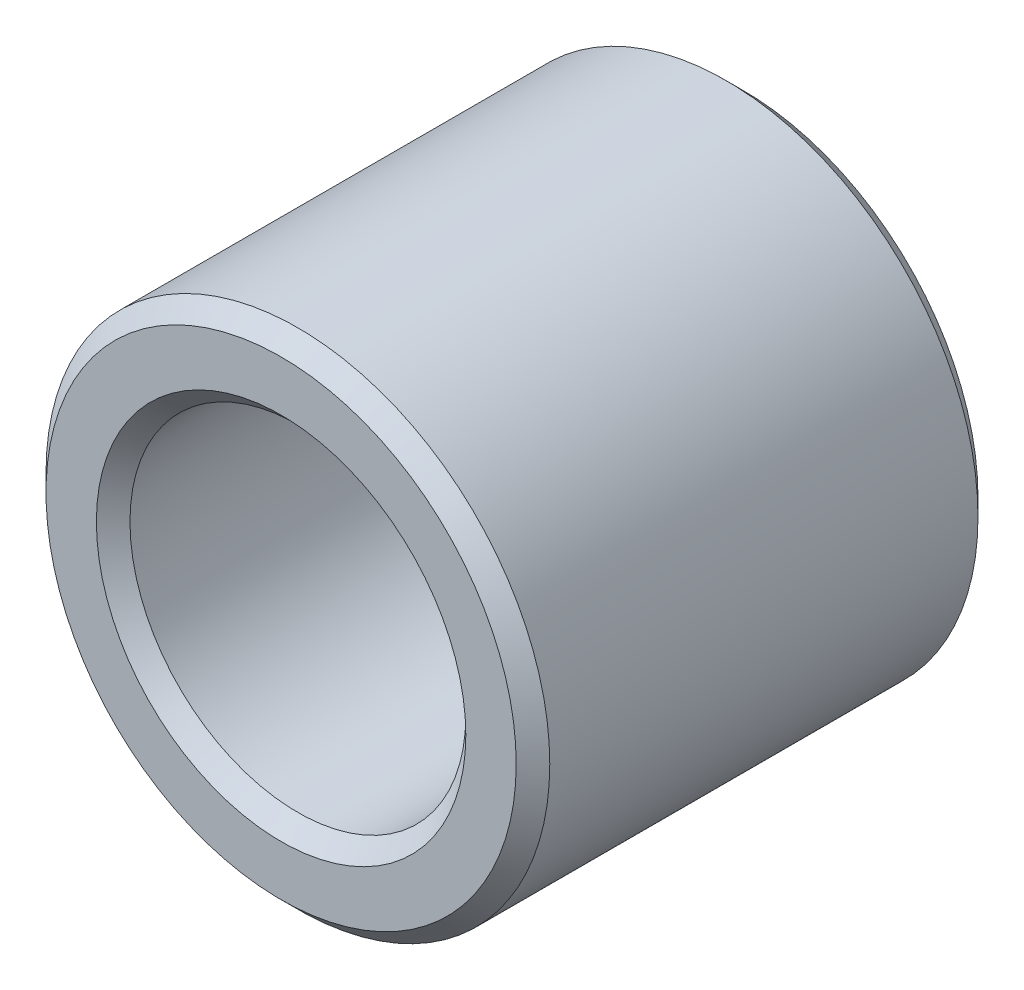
from build123d import *

# Parameters (mm, degrees)
SKETCH1_R           = 60
SKETCH1_R_2         = 40
BOSS_EXTRUDE1_DEPTH = 55
CHAMFER1_SIZE       = 4


with BuildPart() as part:
    # Sketch1 → Boss-Extrude1 (new, symmetric)
    with BuildSketch(Plane.XY):
        Circle(SKETCH1_R)
        Circle(SKETCH1_R_2, mode=Mode.SUBTRACT)
    extrude(amount=BOSS_EXTRUDE1_DEPTH, both=True)

    # Chamfer1
    chamfer1_edges = [part.edges().sort_by_distance(p)[0] for p in [
        (-60, 0, -55),
        (-60, 0, 55),
        (-40, 0, -55),
        (-40, 0, 55),
    ]]
    chamfer(chamfer1_edges, length=CHAMFER1_SIZE)


solid = part.part
